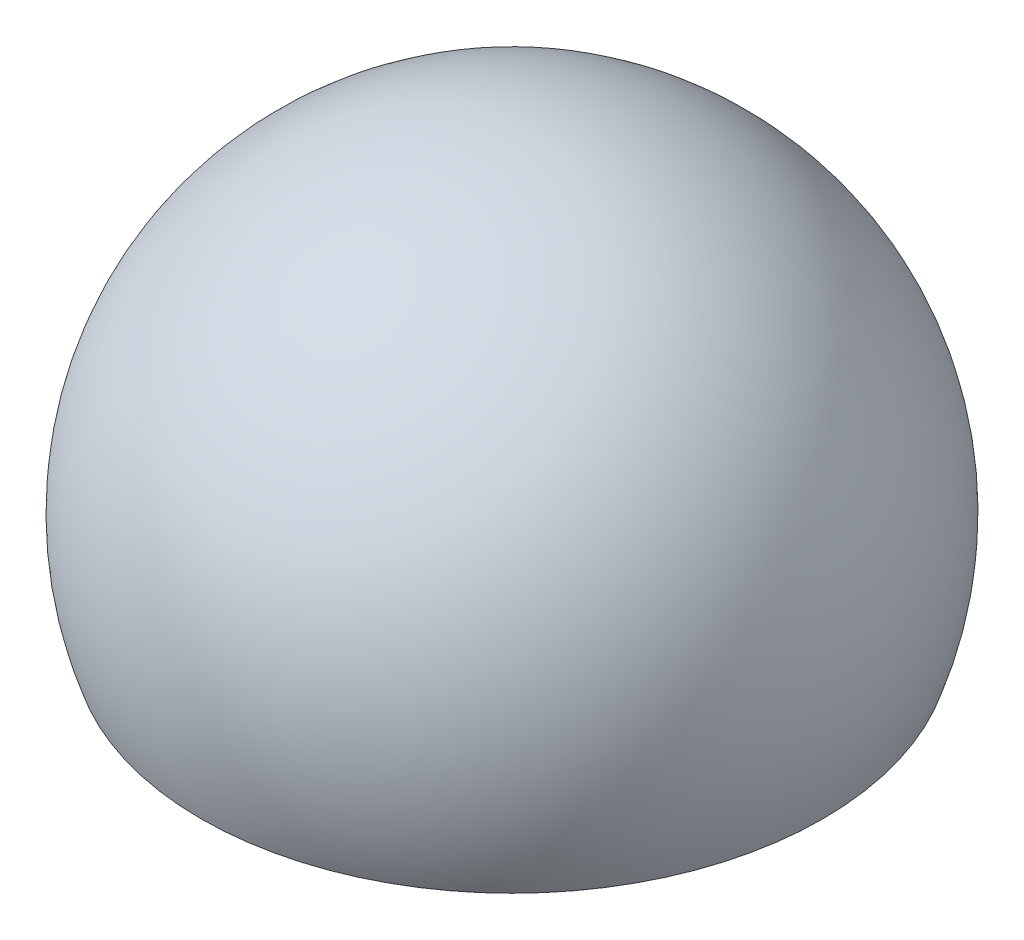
from build123d import *

# Parameters (mm, degrees)
TRUNCATED_BALL_DEPTH      = 5.124445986
TRUNCATED_BALL_DEPTH_BACK = 5.124445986


with BuildPart() as part:
    # Sketch1 → Complete_Ball (revolve)
    with BuildSketch(Plane.XY):
        with BuildLine():
            Line((0, 2.38125), (0, -2.38125))
            ThreePointArc((0, -2.38125), (2.38125, 0), (0, 2.38125))
        make_face()
    revolve(axis=Axis((0, 2.54, 0), (0, -1, 0)))

    # Sketch2 → Truncated_ball (cut, two sides: drawn at the far end of the back side and taken through both)
    with BuildSketch(Plane.XY.offset(-TRUNCATED_BALL_DEPTH_BACK)):
        with BuildLine():
            Line((-2.24506403, -0.79375), (2.24506403, -0.79375))
            ThreePointArc((2.24506403, -0.79375), (0, -2.38125), (-2.24506403, -0.79375))
        make_face()
    extrude(amount=TRUNCATED_BALL_DEPTH + TRUNCATED_BALL_DEPTH_BACK, mode=Mode.SUBTRACT)


solid = part.part
